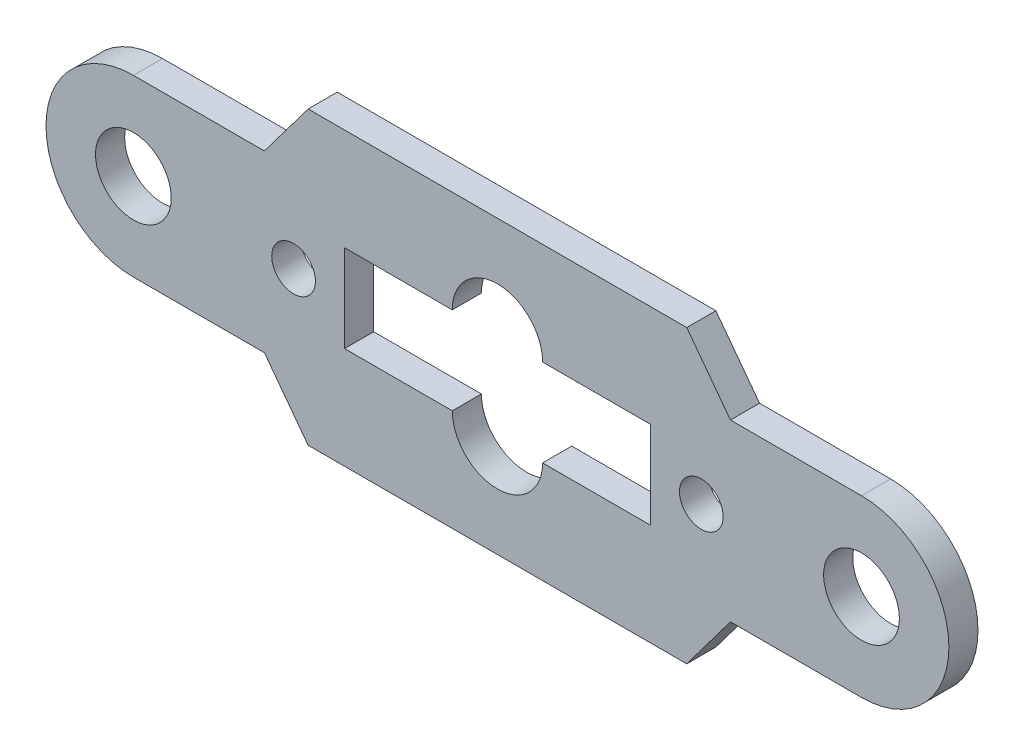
ISO-10303-21;
HEADER;
FILE_DESCRIPTION(('STEP AP214'),'2;1');
FILE_NAME('part.step','',(''),(''),'','','');
FILE_SCHEMA(('AUTOMOTIVE_DESIGN { 1 0 10303 214 1 1 1 1 }'));
ENDSEC;
DATA;
#1=APPLICATION_CONTEXT('core data for automotive mechanical design processes');
#2=APPLICATION_PROTOCOL_DEFINITION('international standard','automotive_design',2000,#1);
#3=PRODUCT_CONTEXT('',#1,'mechanical');
#4=PRODUCT('Part','Part','',(#3));
#5=PRODUCT_RELATED_PRODUCT_CATEGORY('part','',(#4));
#6=PRODUCT_DEFINITION_FORMATION('','',#4);
#7=PRODUCT_DEFINITION_CONTEXT('part definition',#1,'design');
#8=PRODUCT_DEFINITION('design','',#6,#7);
#9=PRODUCT_DEFINITION_SHAPE('','',#8);
#10=(LENGTH_UNIT() NAMED_UNIT(*) SI_UNIT(.MILLI.,.METRE.));
#11=(NAMED_UNIT(*) PLANE_ANGLE_UNIT() SI_UNIT($,.RADIAN.));
#12=(NAMED_UNIT(*) SI_UNIT($,.STERADIAN.) SOLID_ANGLE_UNIT());
#13=UNCERTAINTY_MEASURE_WITH_UNIT(LENGTH_MEASURE(1.E-05),#10,'distance_accuracy_value','');
#14=(GEOMETRIC_REPRESENTATION_CONTEXT(3) GLOBAL_UNCERTAINTY_ASSIGNED_CONTEXT((#13)) GLOBAL_UNIT_ASSIGNED_CONTEXT((#10,
#11,#12)) REPRESENTATION_CONTEXT('',''));
#15=CARTESIAN_POINT('',(0.,0.,0.));
#16=DIRECTION('',(0.,0.,1.));
#17=DIRECTION('',(1.,0.,0.));
#18=AXIS2_PLACEMENT_3D('',#15,#16,#17);
#19=CARTESIAN_POINT('',(12.5,0.,1.));
#20=DIRECTION('',(0.,0.,-1.));
#21=DIRECTION('',(-1.,0.,0.));
#22=AXIS2_PLACEMENT_3D('',#19,#20,#21);
#23=CYLINDRICAL_SURFACE('',#22,3.);
#24=CARTESIAN_POINT('',(12.5,0.,0.));
#25=DIRECTION('',(0.,0.,1.));
#26=DIRECTION('',(-1.,0.,0.));
#27=AXIS2_PLACEMENT_3D('',#24,#25,#26);
#28=CIRCLE('',#27,3.);
#29=CARTESIAN_POINT('',(12.5,-3.,0.));
#30=VERTEX_POINT('',#29);
#31=CARTESIAN_POINT('',(12.5,3.,0.));
#32=VERTEX_POINT('',#31);
#33=EDGE_CURVE('E344',#30,#32,#28,.T.);
#34=ORIENTED_EDGE('',*,*,#33,.T.);
#35=DIRECTION('',(0.,0.,-1.));
#36=VECTOR('',#35,1.);
#37=CARTESIAN_POINT('',(12.5,3.,1.));
#38=LINE('',#37,#36);
#39=CARTESIAN_POINT('',(12.5,3.,1.));
#40=VERTEX_POINT('',#39);
#41=EDGE_CURVE('E11',#40,#32,#38,.T.);
#42=ORIENTED_EDGE('',*,*,#41,.F.);
#43=CARTESIAN_POINT('',(12.5,0.,1.));
#44=DIRECTION('',(0.,0.,1.));
#45=DIRECTION('',(-1.,0.,0.));
#46=AXIS2_PLACEMENT_3D('',#43,#44,#45);
#47=CIRCLE('',#46,3.);
#48=CARTESIAN_POINT('',(12.5,-3.,1.));
#49=VERTEX_POINT('',#48);
#50=EDGE_CURVE('E77',#49,#40,#47,.T.);
#51=ORIENTED_EDGE('',*,*,#50,.F.);
#52=DIRECTION('',(0.,0.,-1.));
#53=VECTOR('',#52,1.);
#54=CARTESIAN_POINT('',(12.5,-3.,1.));
#55=LINE('',#54,#53);
#56=EDGE_CURVE('E313',#49,#30,#55,.T.);
#57=ORIENTED_EDGE('',*,*,#56,.T.);
#58=EDGE_LOOP('',(#34,#42,#51,#57));
#59=FACE_BOUND('',#58,.T.);
#60=ADVANCED_FACE('F32',(#59),#23,.T.);
#61=CARTESIAN_POINT('',(8.00000000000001,3.,1.));
#62=DIRECTION('',(0.,-1.,0.));
#63=DIRECTION('',(0.,0.,-1.));
#64=AXIS2_PLACEMENT_3D('',#61,#62,#63);
#65=PLANE('',#64);
#66=DIRECTION('',(-1.,0.,0.));
#67=VECTOR('',#66,1.);
#68=CARTESIAN_POINT('',(8.00000000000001,3.,0.));
#69=LINE('',#68,#67);
#70=CARTESIAN_POINT('',(8.00000000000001,3.,0.));
#71=VERTEX_POINT('',#70);
#72=EDGE_CURVE('E356',#32,#71,#69,.T.);
#73=ORIENTED_EDGE('',*,*,#72,.T.);
#74=DIRECTION('',(0.,0.,-1.));
#75=VECTOR('',#74,1.);
#76=CARTESIAN_POINT('',(8.00000000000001,3.,1.));
#77=LINE('',#76,#75);
#78=CARTESIAN_POINT('',(8.00000000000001,3.,1.));
#79=VERTEX_POINT('',#78);
#80=EDGE_CURVE('E39',#79,#71,#77,.T.);
#81=ORIENTED_EDGE('',*,*,#80,.F.);
#82=DIRECTION('',(-1.,0.,0.));
#83=VECTOR('',#82,1.);
#84=CARTESIAN_POINT('',(8.00000000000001,3.,1.));
#85=LINE('',#84,#83);
#86=EDGE_CURVE('E348',#40,#79,#85,.T.);
#87=ORIENTED_EDGE('',*,*,#86,.F.);
#88=ORIENTED_EDGE('',*,*,#41,.T.);
#89=EDGE_LOOP('',(#73,#81,#87,#88));
#90=FACE_BOUND('',#89,.T.);
#91=ADVANCED_FACE('F403',(#90),#65,.F.);
#92=CARTESIAN_POINT('',(6.5,5.,1.));
#93=DIRECTION('',(-0.799999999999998,-0.600000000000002,0.));
#94=DIRECTION('',(0.600000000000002,-0.799999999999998,0.));
#95=AXIS2_PLACEMENT_3D('',#92,#93,#94);
#96=PLANE('',#95);
#97=DIRECTION('',(-0.600000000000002,0.799999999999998,0.));
#98=VECTOR('',#97,1.);
#99=CARTESIAN_POINT('',(6.5,5.,0.));
#100=LINE('',#99,#98);
#101=CARTESIAN_POINT('',(6.5,5.,0.));
#102=VERTEX_POINT('',#101);
#103=EDGE_CURVE('E72',#71,#102,#100,.T.);
#104=ORIENTED_EDGE('',*,*,#103,.T.);
#105=DIRECTION('',(0.,0.,-1.));
#106=VECTOR('',#105,1.);
#107=CARTESIAN_POINT('',(6.5,5.,1.));
#108=LINE('',#107,#106);
#109=CARTESIAN_POINT('',(6.5,5.,1.));
#110=VERTEX_POINT('',#109);
#111=EDGE_CURVE('E354',#110,#102,#108,.T.);
#112=ORIENTED_EDGE('',*,*,#111,.F.);
#113=DIRECTION('',(-0.600000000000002,0.799999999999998,0.));
#114=VECTOR('',#113,1.);
#115=CARTESIAN_POINT('',(6.5,5.,1.));
#116=LINE('',#115,#114);
#117=EDGE_CURVE('E55',#79,#110,#116,.T.);
#118=ORIENTED_EDGE('',*,*,#117,.F.);
#119=ORIENTED_EDGE('',*,*,#80,.T.);
#120=EDGE_LOOP('',(#104,#112,#118,#119));
#121=FACE_BOUND('',#120,.T.);
#122=ADVANCED_FACE('F361',(#121),#96,.F.);
#123=CARTESIAN_POINT('',(0.,5.,1.));
#124=DIRECTION('',(0.,-1.,0.));
#125=DIRECTION('',(0.,0.,-1.));
#126=AXIS2_PLACEMENT_3D('',#123,#124,#125);
#127=PLANE('',#126);
#128=DIRECTION('',(-1.,0.,0.));
#129=VECTOR('',#128,1.);
#130=CARTESIAN_POINT('',(0.,5.,0.));
#131=LINE('',#130,#129);
#132=CARTESIAN_POINT('',(-6.5,5.,0.));
#133=VERTEX_POINT('',#132);
#134=EDGE_CURVE('E349',#102,#133,#131,.T.);
#135=ORIENTED_EDGE('',*,*,#134,.T.);
#136=DIRECTION('',(0.,0.,-1.));
#137=VECTOR('',#136,1.);
#138=CARTESIAN_POINT('',(-6.5,5.,1.));
#139=LINE('',#138,#137);
#140=CARTESIAN_POINT('',(-6.5,5.,1.));
#141=VERTEX_POINT('',#140);
#142=EDGE_CURVE('E266',#141,#133,#139,.T.);
#143=ORIENTED_EDGE('',*,*,#142,.F.);
#144=DIRECTION('',(-1.,0.,0.));
#145=VECTOR('',#144,1.);
#146=CARTESIAN_POINT('',(0.,5.,1.));
#147=LINE('',#146,#145);
#148=EDGE_CURVE('E352',#110,#141,#147,.T.);
#149=ORIENTED_EDGE('',*,*,#148,.F.);
#150=ORIENTED_EDGE('',*,*,#111,.T.);
#151=EDGE_LOOP('',(#135,#143,#149,#150));
#152=FACE_BOUND('',#151,.T.);
#153=ADVANCED_FACE('F370',(#152),#127,.F.);
#154=CARTESIAN_POINT('',(12.5,0.,1.));
#155=DIRECTION('',(0.,0.,-1.));
#156=DIRECTION('',(-1.,0.,0.));
#157=AXIS2_PLACEMENT_3D('',#154,#155,#156);
#158=PLANE('',#157);
#159=DIRECTION('',(1.,0.,0.));
#160=VECTOR('',#159,1.);
#161=CARTESIAN_POINT('',(-1.55,1.5,1.));
#162=LINE('',#161,#160);
#163=CARTESIAN_POINT('',(-5.25,1.5,1.));
#164=VERTEX_POINT('',#163);
#165=CARTESIAN_POINT('',(-1.55,1.5,1.));
#166=VERTEX_POINT('',#165);
#167=EDGE_CURVE('E237',#164,#166,#162,.T.);
#168=ORIENTED_EDGE('',*,*,#167,.T.);
#169=CARTESIAN_POINT('',(0.,1.5,1.));
#170=DIRECTION('',(0.,0.,1.));
#171=DIRECTION('',(1.,0.,0.));
#172=AXIS2_PLACEMENT_3D('',#169,#170,#171);
#173=CIRCLE('',#172,1.55);
#174=CARTESIAN_POINT('',(1.55,1.5,1.));
#175=VERTEX_POINT('',#174);
#176=EDGE_CURVE('E326',#175,#166,#173,.T.);
#177=ORIENTED_EDGE('',*,*,#176,.F.);
#178=DIRECTION('',(-1.,0.,0.));
#179=VECTOR('',#178,1.);
#180=CARTESIAN_POINT('',(1.55,1.5,1.));
#181=LINE('',#180,#179);
#182=CARTESIAN_POINT('',(5.25,1.5,1.));
#183=VERTEX_POINT('',#182);
#184=EDGE_CURVE('E333',#183,#175,#181,.T.);
#185=ORIENTED_EDGE('',*,*,#184,.F.);
#186=DIRECTION('',(0.,1.,0.));
#187=VECTOR('',#186,1.);
#188=CARTESIAN_POINT('',(5.25,0.,1.));
#189=LINE('',#188,#187);
#190=CARTESIAN_POINT('',(5.25,-1.5,1.));
#191=VERTEX_POINT('',#190);
#192=EDGE_CURVE('E320',#191,#183,#189,.T.);
#193=ORIENTED_EDGE('',*,*,#192,.F.);
#194=DIRECTION('',(-1.,0.,0.));
#195=VECTOR('',#194,1.);
#196=CARTESIAN_POINT('',(1.55,-1.5,1.));
#197=LINE('',#196,#195);
#198=CARTESIAN_POINT('',(1.55,-1.5,1.));
#199=VERTEX_POINT('',#198);
#200=EDGE_CURVE('E282',#191,#199,#197,.T.);
#201=ORIENTED_EDGE('',*,*,#200,.T.);
#202=CARTESIAN_POINT('',(0.,-1.5,1.));
#203=DIRECTION('',(0.,0.,-1.));
#204=DIRECTION('',(1.,0.,0.));
#205=AXIS2_PLACEMENT_3D('',#202,#203,#204);
#206=CIRCLE('',#205,1.55);
#207=CARTESIAN_POINT('',(-1.55,-1.5,1.));
#208=VERTEX_POINT('',#207);
#209=EDGE_CURVE('E283',#199,#208,#206,.T.);
#210=ORIENTED_EDGE('',*,*,#209,.T.);
#211=DIRECTION('',(1.,0.,0.));
#212=VECTOR('',#211,1.);
#213=CARTESIAN_POINT('',(-1.55,-1.5,1.));
#214=LINE('',#213,#212);
#215=CARTESIAN_POINT('',(-5.25,-1.5,1.));
#216=VERTEX_POINT('',#215);
#217=EDGE_CURVE('E195',#216,#208,#214,.T.);
#218=ORIENTED_EDGE('',*,*,#217,.F.);
#219=DIRECTION('',(0.,1.,0.));
#220=VECTOR('',#219,1.);
#221=CARTESIAN_POINT('',(-5.25,0.,1.));
#222=LINE('',#221,#220);
#223=EDGE_CURVE('E232',#216,#164,#222,.T.);
#224=ORIENTED_EDGE('',*,*,#223,.T.);
#225=EDGE_LOOP('',(#168,#177,#185,#193,#201,#210,#218,#224));
#226=FACE_BOUND('',#225,.T.);
#227=CARTESIAN_POINT('',(7.,0.,1.));
#228=DIRECTION('',(0.,0.,1.));
#229=DIRECTION('',(1.,0.,0.));
#230=AXIS2_PLACEMENT_3D('',#227,#228,#229);
#231=CIRCLE('',#230,0.750000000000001);
#232=CARTESIAN_POINT('',(7.75,0.,1.));
#233=VERTEX_POINT('',#232);
#234=EDGE_CURVE('E316',#233,#233,#231,.T.);
#235=ORIENTED_EDGE('',*,*,#234,.F.);
#236=EDGE_LOOP('',(#235));
#237=FACE_BOUND('',#236,.T.);
#238=CARTESIAN_POINT('',(12.5,0.,1.));
#239=DIRECTION('',(0.,0.,1.));
#240=DIRECTION('',(1.,0.,0.));
#241=AXIS2_PLACEMENT_3D('',#238,#239,#240);
#242=CIRCLE('',#241,1.3);
#243=CARTESIAN_POINT('',(13.8,0.,1.));
#244=VERTEX_POINT('',#243);
#245=EDGE_CURVE('E339',#244,#244,#242,.T.);
#246=ORIENTED_EDGE('',*,*,#245,.F.);
#247=EDGE_LOOP('',(#246));
#248=FACE_BOUND('',#247,.T.);
#249=ORIENTED_EDGE('',*,*,#148,.T.);
#250=DIRECTION('',(0.600000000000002,0.799999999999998,0.));
#251=VECTOR('',#250,1.);
#252=CARTESIAN_POINT('',(-6.5,5.,1.));
#253=LINE('',#252,#251);
#254=CARTESIAN_POINT('',(-8.00000000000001,3.,1.));
#255=VERTEX_POINT('',#254);
#256=EDGE_CURVE('E263',#255,#141,#253,.T.);
#257=ORIENTED_EDGE('',*,*,#256,.F.);
#258=DIRECTION('',(1.,0.,0.));
#259=VECTOR('',#258,1.);
#260=CARTESIAN_POINT('',(-8.00000000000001,3.,1.));
#261=LINE('',#260,#259);
#262=CARTESIAN_POINT('',(-12.5,3.,1.));
#263=VERTEX_POINT('',#262);
#264=EDGE_CURVE('E259',#263,#255,#261,.T.);
#265=ORIENTED_EDGE('',*,*,#264,.F.);
#266=CARTESIAN_POINT('',(-12.5,0.,1.));
#267=DIRECTION('',(0.,0.,-1.));
#268=DIRECTION('',(1.,0.,0.));
#269=AXIS2_PLACEMENT_3D('',#266,#267,#268);
#270=CIRCLE('',#269,3.);
#271=CARTESIAN_POINT('',(-12.5,-3.,1.));
#272=VERTEX_POINT('',#271);
#273=EDGE_CURVE('E256',#272,#263,#270,.T.);
#274=ORIENTED_EDGE('',*,*,#273,.F.);
#275=DIRECTION('',(1.,0.,0.));
#276=VECTOR('',#275,1.);
#277=CARTESIAN_POINT('',(-8.00000000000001,-3.,1.));
#278=LINE('',#277,#276);
#279=CARTESIAN_POINT('',(-8.00000000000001,-3.,1.));
#280=VERTEX_POINT('',#279);
#281=EDGE_CURVE('E209',#272,#280,#278,.T.);
#282=ORIENTED_EDGE('',*,*,#281,.T.);
#283=DIRECTION('',(0.600000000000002,-0.799999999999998,0.));
#284=VECTOR('',#283,1.);
#285=CARTESIAN_POINT('',(-6.5,-5.,1.));
#286=LINE('',#285,#284);
#287=CARTESIAN_POINT('',(-6.5,-5.,1.));
#288=VERTEX_POINT('',#287);
#289=EDGE_CURVE('E212',#280,#288,#286,.T.);
#290=ORIENTED_EDGE('',*,*,#289,.T.);
#291=DIRECTION('',(-1.,0.,0.));
#292=VECTOR('',#291,1.);
#293=CARTESIAN_POINT('',(0.,-5.,1.));
#294=LINE('',#293,#292);
#295=CARTESIAN_POINT('',(6.5,-5.,1.));
#296=VERTEX_POINT('',#295);
#297=EDGE_CURVE('E299',#296,#288,#294,.T.);
#298=ORIENTED_EDGE('',*,*,#297,.F.);
#299=DIRECTION('',(-0.600000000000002,-0.799999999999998,0.));
#300=VECTOR('',#299,1.);
#301=CARTESIAN_POINT('',(6.5,-5.,1.));
#302=LINE('',#301,#300);
#303=CARTESIAN_POINT('',(8.00000000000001,-3.,1.));
#304=VERTEX_POINT('',#303);
#305=EDGE_CURVE('E295',#304,#296,#302,.T.);
#306=ORIENTED_EDGE('',*,*,#305,.F.);
#307=DIRECTION('',(-1.,0.,0.));
#308=VECTOR('',#307,1.);
#309=CARTESIAN_POINT('',(8.00000000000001,-3.,1.));
#310=LINE('',#309,#308);
#311=EDGE_CURVE('E292',#49,#304,#310,.T.);
#312=ORIENTED_EDGE('',*,*,#311,.F.);
#313=ORIENTED_EDGE('',*,*,#50,.T.);
#314=ORIENTED_EDGE('',*,*,#86,.T.);
#315=ORIENTED_EDGE('',*,*,#117,.T.);
#316=EDGE_LOOP('',(#249,#257,#265,#274,#282,#290,#298,#306,#312,#313,#314,#315));
#317=FACE_BOUND('',#316,.T.);
#318=CARTESIAN_POINT('',(-7.,0.,1.));
#319=DIRECTION('',(0.,0.,-1.));
#320=DIRECTION('',(-1.,0.,0.));
#321=AXIS2_PLACEMENT_3D('',#318,#319,#320);
#322=CIRCLE('',#321,0.750000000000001);
#323=CARTESIAN_POINT('',(-7.75,0.,1.));
#324=VERTEX_POINT('',#323);
#325=EDGE_CURVE('E228',#324,#324,#322,.T.);
#326=ORIENTED_EDGE('',*,*,#325,.T.);
#327=EDGE_LOOP('',(#326));
#328=FACE_BOUND('',#327,.T.);
#329=CARTESIAN_POINT('',(-12.5,0.,1.));
#330=DIRECTION('',(0.,0.,-1.));
#331=DIRECTION('',(-1.,0.,0.));
#332=AXIS2_PLACEMENT_3D('',#329,#330,#331);
#333=CIRCLE('',#332,1.3);
#334=CARTESIAN_POINT('',(-13.8,0.,1.));
#335=VERTEX_POINT('',#334);
#336=EDGE_CURVE('E248',#335,#335,#333,.T.);
#337=ORIENTED_EDGE('',*,*,#336,.T.);
#338=EDGE_LOOP('',(#337));
#339=FACE_BOUND('',#338,.T.);
#340=ADVANCED_FACE('F375',(#226,#237,#248,#317,#328,#339),#158,.F.);
#341=CARTESIAN_POINT('',(12.5,0.,0.));
#342=DIRECTION('',(0.,0.,-1.));
#343=DIRECTION('',(-1.,0.,0.));
#344=AXIS2_PLACEMENT_3D('',#341,#342,#343);
#345=PLANE('',#344);
#346=CARTESIAN_POINT('',(0.,1.5,0.));
#347=DIRECTION('',(0.,0.,1.));
#348=DIRECTION('',(1.,0.,0.));
#349=AXIS2_PLACEMENT_3D('',#346,#347,#348);
#350=CIRCLE('',#349,1.55);
#351=CARTESIAN_POINT('',(1.55,1.5,0.));
#352=VERTEX_POINT('',#351);
#353=CARTESIAN_POINT('',(-1.55,1.5,0.));
#354=VERTEX_POINT('',#353);
#355=EDGE_CURVE('E328',#352,#354,#350,.T.);
#356=ORIENTED_EDGE('',*,*,#355,.T.);
#357=DIRECTION('',(1.,0.,0.));
#358=VECTOR('',#357,1.);
#359=CARTESIAN_POINT('',(-1.55,1.5,0.));
#360=LINE('',#359,#358);
#361=CARTESIAN_POINT('',(-5.25,1.5,0.));
#362=VERTEX_POINT('',#361);
#363=EDGE_CURVE('E236',#362,#354,#360,.T.);
#364=ORIENTED_EDGE('',*,*,#363,.F.);
#365=DIRECTION('',(0.,1.,0.));
#366=VECTOR('',#365,1.);
#367=CARTESIAN_POINT('',(-5.25,0.,0.));
#368=LINE('',#367,#366);
#369=CARTESIAN_POINT('',(-5.25,-1.5,0.));
#370=VERTEX_POINT('',#369);
#371=EDGE_CURVE('E204',#370,#362,#368,.T.);
#372=ORIENTED_EDGE('',*,*,#371,.F.);
#373=DIRECTION('',(1.,0.,0.));
#374=VECTOR('',#373,1.);
#375=CARTESIAN_POINT('',(-1.55,-1.5,0.));
#376=LINE('',#375,#374);
#377=CARTESIAN_POINT('',(-1.55,-1.5,0.));
#378=VERTEX_POINT('',#377);
#379=EDGE_CURVE('E193',#370,#378,#376,.T.);
#380=ORIENTED_EDGE('',*,*,#379,.T.);
#381=CARTESIAN_POINT('',(0.,-1.5,0.));
#382=DIRECTION('',(0.,0.,-1.));
#383=DIRECTION('',(1.,0.,0.));
#384=AXIS2_PLACEMENT_3D('',#381,#382,#383);
#385=CIRCLE('',#384,1.55);
#386=CARTESIAN_POINT('',(1.55,-1.5,0.));
#387=VERTEX_POINT('',#386);
#388=EDGE_CURVE('E176',#387,#378,#385,.T.);
#389=ORIENTED_EDGE('',*,*,#388,.F.);
#390=DIRECTION('',(-1.,0.,0.));
#391=VECTOR('',#390,1.);
#392=CARTESIAN_POINT('',(1.55,-1.5,0.));
#393=LINE('',#392,#391);
#394=CARTESIAN_POINT('',(5.25,-1.5,0.));
#395=VERTEX_POINT('',#394);
#396=EDGE_CURVE('E188',#395,#387,#393,.T.);
#397=ORIENTED_EDGE('',*,*,#396,.F.);
#398=DIRECTION('',(0.,1.,0.));
#399=VECTOR('',#398,1.);
#400=CARTESIAN_POINT('',(5.25,0.,0.));
#401=LINE('',#400,#399);
#402=CARTESIAN_POINT('',(5.25,1.5,0.));
#403=VERTEX_POINT('',#402);
#404=EDGE_CURVE('E323',#395,#403,#401,.T.);
#405=ORIENTED_EDGE('',*,*,#404,.T.);
#406=DIRECTION('',(-1.,0.,0.));
#407=VECTOR('',#406,1.);
#408=CARTESIAN_POINT('',(1.55,1.5,0.));
#409=LINE('',#408,#407);
#410=EDGE_CURVE('E46',#403,#352,#409,.T.);
#411=ORIENTED_EDGE('',*,*,#410,.T.);
#412=EDGE_LOOP('',(#356,#364,#372,#380,#389,#397,#405,#411));
#413=FACE_BOUND('',#412,.T.);
#414=CARTESIAN_POINT('',(7.,0.,0.));
#415=DIRECTION('',(0.,0.,1.));
#416=DIRECTION('',(1.,0.,0.));
#417=AXIS2_PLACEMENT_3D('',#414,#415,#416);
#418=CIRCLE('',#417,0.750000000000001);
#419=CARTESIAN_POINT('',(7.75,0.,0.));
#420=VERTEX_POINT('',#419);
#421=EDGE_CURVE('E317',#420,#420,#418,.T.);
#422=ORIENTED_EDGE('',*,*,#421,.T.);
#423=EDGE_LOOP('',(#422));
#424=FACE_BOUND('',#423,.T.);
#425=CARTESIAN_POINT('',(12.5,0.,0.));
#426=DIRECTION('',(0.,0.,1.));
#427=DIRECTION('',(1.,0.,0.));
#428=AXIS2_PLACEMENT_3D('',#425,#426,#427);
#429=CIRCLE('',#428,1.3);
#430=CARTESIAN_POINT('',(13.8,0.,0.));
#431=VERTEX_POINT('',#430);
#432=EDGE_CURVE('E341',#431,#431,#429,.T.);
#433=ORIENTED_EDGE('',*,*,#432,.T.);
#434=EDGE_LOOP('',(#433));
#435=FACE_BOUND('',#434,.T.);
#436=DIRECTION('',(0.600000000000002,0.799999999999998,0.));
#437=VECTOR('',#436,1.);
#438=CARTESIAN_POINT('',(-6.5,5.,0.));
#439=LINE('',#438,#437);
#440=CARTESIAN_POINT('',(-8.00000000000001,3.,0.));
#441=VERTEX_POINT('',#440);
#442=EDGE_CURVE('E260',#441,#133,#439,.T.);
#443=ORIENTED_EDGE('',*,*,#442,.T.);
#444=ORIENTED_EDGE('',*,*,#134,.F.);
#445=ORIENTED_EDGE('',*,*,#103,.F.);
#446=ORIENTED_EDGE('',*,*,#72,.F.);
#447=ORIENTED_EDGE('',*,*,#33,.F.);
#448=DIRECTION('',(-1.,0.,0.));
#449=VECTOR('',#448,1.);
#450=CARTESIAN_POINT('',(8.00000000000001,-3.,0.));
#451=LINE('',#450,#449);
#452=CARTESIAN_POINT('',(8.00000000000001,-3.,0.));
#453=VERTEX_POINT('',#452);
#454=EDGE_CURVE('E289',#30,#453,#451,.T.);
#455=ORIENTED_EDGE('',*,*,#454,.T.);
#456=DIRECTION('',(-0.600000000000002,-0.799999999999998,0.));
#457=VECTOR('',#456,1.);
#458=CARTESIAN_POINT('',(6.5,-5.,0.));
#459=LINE('',#458,#457);
#460=CARTESIAN_POINT('',(6.5,-5.,0.));
#461=VERTEX_POINT('',#460);
#462=EDGE_CURVE('E304',#453,#461,#459,.T.);
#463=ORIENTED_EDGE('',*,*,#462,.T.);
#464=DIRECTION('',(-1.,0.,0.));
#465=VECTOR('',#464,1.);
#466=CARTESIAN_POINT('',(0.,-5.,0.));
#467=LINE('',#466,#465);
#468=CARTESIAN_POINT('',(-6.5,-5.,0.));
#469=VERTEX_POINT('',#468);
#470=EDGE_CURVE('E296',#461,#469,#467,.T.);
#471=ORIENTED_EDGE('',*,*,#470,.T.);
#472=DIRECTION('',(0.600000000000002,-0.799999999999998,0.));
#473=VECTOR('',#472,1.);
#474=CARTESIAN_POINT('',(-6.5,-5.,0.));
#475=LINE('',#474,#473);
#476=CARTESIAN_POINT('',(-8.00000000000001,-3.,0.));
#477=VERTEX_POINT('',#476);
#478=EDGE_CURVE('E213',#477,#469,#475,.T.);
#479=ORIENTED_EDGE('',*,*,#478,.F.);
#480=DIRECTION('',(1.,0.,0.));
#481=VECTOR('',#480,1.);
#482=CARTESIAN_POINT('',(-8.00000000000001,-3.,0.));
#483=LINE('',#482,#481);
#484=CARTESIAN_POINT('',(-12.5,-3.,0.));
#485=VERTEX_POINT('',#484);
#486=EDGE_CURVE('E196',#485,#477,#483,.T.);
#487=ORIENTED_EDGE('',*,*,#486,.F.);
#488=CARTESIAN_POINT('',(-12.5,0.,0.));
#489=DIRECTION('',(0.,0.,-1.));
#490=DIRECTION('',(1.,0.,0.));
#491=AXIS2_PLACEMENT_3D('',#488,#489,#490);
#492=CIRCLE('',#491,3.);
#493=CARTESIAN_POINT('',(-12.5,3.,0.));
#494=VERTEX_POINT('',#493);
#495=EDGE_CURVE('E253',#485,#494,#492,.T.);
#496=ORIENTED_EDGE('',*,*,#495,.T.);
#497=DIRECTION('',(1.,0.,0.));
#498=VECTOR('',#497,1.);
#499=CARTESIAN_POINT('',(-8.00000000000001,3.,0.));
#500=LINE('',#499,#498);
#501=EDGE_CURVE('E269',#494,#441,#500,.T.);
#502=ORIENTED_EDGE('',*,*,#501,.T.);
#503=EDGE_LOOP('',(#443,#444,#445,#446,#447,#455,#463,#471,#479,#487,#496,#502));
#504=FACE_BOUND('',#503,.T.);
#505=CARTESIAN_POINT('',(-7.,0.,0.));
#506=DIRECTION('',(0.,0.,-1.));
#507=DIRECTION('',(-1.,0.,0.));
#508=AXIS2_PLACEMENT_3D('',#505,#506,#507);
#509=CIRCLE('',#508,0.750000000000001);
#510=CARTESIAN_POINT('',(-7.75,0.,0.));
#511=VERTEX_POINT('',#510);
#512=EDGE_CURVE('E229',#511,#511,#509,.T.);
#513=ORIENTED_EDGE('',*,*,#512,.F.);
#514=EDGE_LOOP('',(#513));
#515=FACE_BOUND('',#514,.T.);
#516=CARTESIAN_POINT('',(-12.5,0.,0.));
#517=DIRECTION('',(0.,0.,-1.));
#518=DIRECTION('',(-1.,0.,0.));
#519=AXIS2_PLACEMENT_3D('',#516,#517,#518);
#520=CIRCLE('',#519,1.3);
#521=CARTESIAN_POINT('',(-13.8,0.,0.));
#522=VERTEX_POINT('',#521);
#523=EDGE_CURVE('E250',#522,#522,#520,.T.);
#524=ORIENTED_EDGE('',*,*,#523,.F.);
#525=EDGE_LOOP('',(#524));
#526=FACE_BOUND('',#525,.T.);
#527=ADVANCED_FACE('F200',(#413,#424,#435,#504,#515,#526),#345,.T.);
#528=CARTESIAN_POINT('',(12.5,0.,0.));
#529=DIRECTION('',(0.,0.,1.));
#530=DIRECTION('',(1.,0.,0.));
#531=AXIS2_PLACEMENT_3D('',#528,#529,#530);
#532=CYLINDRICAL_SURFACE('',#531,1.3);
#533=ORIENTED_EDGE('',*,*,#245,.T.);
#534=EDGE_LOOP('',(#533));
#535=FACE_BOUND('',#534,.T.);
#536=ORIENTED_EDGE('',*,*,#432,.F.);
#537=EDGE_LOOP('',(#536));
#538=FACE_BOUND('',#537,.T.);
#539=ADVANCED_FACE('F415',(#535,#538),#532,.F.);
#540=CARTESIAN_POINT('',(0.,1.5,0.));
#541=DIRECTION('',(0.,0.,1.));
#542=DIRECTION('',(1.,0.,0.));
#543=AXIS2_PLACEMENT_3D('',#540,#541,#542);
#544=CYLINDRICAL_SURFACE('',#543,1.55);
#545=ORIENTED_EDGE('',*,*,#355,.F.);
#546=DIRECTION('',(0.,0.,1.));
#547=VECTOR('',#546,1.);
#548=CARTESIAN_POINT('',(1.55,1.5,0.));
#549=LINE('',#548,#547);
#550=EDGE_CURVE('E337',#352,#175,#549,.T.);
#551=ORIENTED_EDGE('',*,*,#550,.T.);
#552=ORIENTED_EDGE('',*,*,#176,.T.);
#553=DIRECTION('',(0.,0.,1.));
#554=VECTOR('',#553,1.);
#555=CARTESIAN_POINT('',(-1.55,1.5,0.));
#556=LINE('',#555,#554);
#557=EDGE_CURVE('E245',#354,#166,#556,.T.);
#558=ORIENTED_EDGE('',*,*,#557,.F.);
#559=EDGE_LOOP('',(#545,#551,#552,#558));
#560=FACE_BOUND('',#559,.T.);
#561=ADVANCED_FACE('F421',(#560),#544,.F.);
#562=CARTESIAN_POINT('',(1.55,1.5,0.));
#563=DIRECTION('',(0.,1.,0.));
#564=DIRECTION('',(-1.,0.,0.));
#565=AXIS2_PLACEMENT_3D('',#562,#563,#564);
#566=PLANE('',#565);
#567=ORIENTED_EDGE('',*,*,#184,.T.);
#568=ORIENTED_EDGE('',*,*,#550,.F.);
#569=ORIENTED_EDGE('',*,*,#410,.F.);
#570=DIRECTION('',(0.,0.,1.));
#571=VECTOR('',#570,1.);
#572=CARTESIAN_POINT('',(5.25,1.5,0.));
#573=LINE('',#572,#571);
#574=EDGE_CURVE('E330',#403,#183,#573,.T.);
#575=ORIENTED_EDGE('',*,*,#574,.T.);
#576=EDGE_LOOP('',(#567,#568,#569,#575));
#577=FACE_BOUND('',#576,.T.);
#578=ADVANCED_FACE('F427',(#577),#566,.F.);
#579=CARTESIAN_POINT('',(5.25,0.,0.));
#580=DIRECTION('',(1.,0.,0.));
#581=DIRECTION('',(0.,0.,-1.));
#582=AXIS2_PLACEMENT_3D('',#579,#580,#581);
#583=PLANE('',#582);
#584=ORIENTED_EDGE('',*,*,#192,.T.);
#585=ORIENTED_EDGE('',*,*,#574,.F.);
#586=ORIENTED_EDGE('',*,*,#404,.F.);
#587=DIRECTION('',(0.,0.,1.));
#588=VECTOR('',#587,1.);
#589=CARTESIAN_POINT('',(5.25,-1.5,0.));
#590=LINE('',#589,#588);
#591=EDGE_CURVE('E187',#395,#191,#590,.T.);
#592=ORIENTED_EDGE('',*,*,#591,.T.);
#593=EDGE_LOOP('',(#584,#585,#586,#592));
#594=FACE_BOUND('',#593,.T.);
#595=ADVANCED_FACE('F423',(#594),#583,.F.);
#596=CARTESIAN_POINT('',(7.,0.,0.));
#597=DIRECTION('',(0.,0.,1.));
#598=DIRECTION('',(1.,0.,0.));
#599=AXIS2_PLACEMENT_3D('',#596,#597,#598);
#600=CYLINDRICAL_SURFACE('',#599,0.750000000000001);
#601=ORIENTED_EDGE('',*,*,#234,.T.);
#602=EDGE_LOOP('',(#601));
#603=FACE_BOUND('',#602,.T.);
#604=ORIENTED_EDGE('',*,*,#421,.F.);
#605=EDGE_LOOP('',(#604));
#606=FACE_BOUND('',#605,.T.);
#607=ADVANCED_FACE('F426',(#603,#606),#600,.F.);
#608=CARTESIAN_POINT('',(8.00000000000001,-3.,1.));
#609=DIRECTION('',(0.,1.,0.));
#610=DIRECTION('',(0.,0.,-1.));
#611=AXIS2_PLACEMENT_3D('',#608,#609,#610);
#612=PLANE('',#611);
#613=ORIENTED_EDGE('',*,*,#454,.F.);
#614=ORIENTED_EDGE('',*,*,#56,.F.);
#615=ORIENTED_EDGE('',*,*,#311,.T.);
#616=DIRECTION('',(0.,0.,-1.));
#617=VECTOR('',#616,1.);
#618=CARTESIAN_POINT('',(8.00000000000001,-3.,1.));
#619=LINE('',#618,#617);
#620=EDGE_CURVE('E310',#304,#453,#619,.T.);
#621=ORIENTED_EDGE('',*,*,#620,.T.);
#622=EDGE_LOOP('',(#613,#614,#615,#621));
#623=FACE_BOUND('',#622,.T.);
#624=ADVANCED_FACE('F401',(#623),#612,.F.);
#625=CARTESIAN_POINT('',(6.5,-5.,1.));
#626=DIRECTION('',(-0.799999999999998,0.600000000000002,0.));
#627=DIRECTION('',(0.600000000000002,0.799999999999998,0.));
#628=AXIS2_PLACEMENT_3D('',#625,#626,#627);
#629=PLANE('',#628);
#630=ORIENTED_EDGE('',*,*,#462,.F.);
#631=ORIENTED_EDGE('',*,*,#620,.F.);
#632=ORIENTED_EDGE('',*,*,#305,.T.);
#633=DIRECTION('',(0.,0.,-1.));
#634=VECTOR('',#633,1.);
#635=CARTESIAN_POINT('',(6.5,-5.,1.));
#636=LINE('',#635,#634);
#637=EDGE_CURVE('E301',#296,#461,#636,.T.);
#638=ORIENTED_EDGE('',*,*,#637,.T.);
#639=EDGE_LOOP('',(#630,#631,#632,#638));
#640=FACE_BOUND('',#639,.T.);
#641=ADVANCED_FACE('F397',(#640),#629,.F.);
#642=CARTESIAN_POINT('',(0.,-5.,1.));
#643=DIRECTION('',(0.,1.,0.));
#644=DIRECTION('',(0.,0.,-1.));
#645=AXIS2_PLACEMENT_3D('',#642,#643,#644);
#646=PLANE('',#645);
#647=ORIENTED_EDGE('',*,*,#470,.F.);
#648=ORIENTED_EDGE('',*,*,#637,.F.);
#649=ORIENTED_EDGE('',*,*,#297,.T.);
#650=DIRECTION('',(0.,0.,-1.));
#651=VECTOR('',#650,1.);
#652=CARTESIAN_POINT('',(-6.5,-5.,1.));
#653=LINE('',#652,#651);
#654=EDGE_CURVE('E216',#288,#469,#653,.T.);
#655=ORIENTED_EDGE('',*,*,#654,.T.);
#656=EDGE_LOOP('',(#647,#648,#649,#655));
#657=FACE_BOUND('',#656,.T.);
#658=ADVANCED_FACE('F394',(#657),#646,.F.);
#659=CARTESIAN_POINT('',(0.,-1.5,0.));
#660=DIRECTION('',(0.,0.,1.));
#661=DIRECTION('',(1.,0.,0.));
#662=AXIS2_PLACEMENT_3D('',#659,#660,#661);
#663=CYLINDRICAL_SURFACE('',#662,1.55);
#664=ORIENTED_EDGE('',*,*,#388,.T.);
#665=DIRECTION('',(0.,0.,1.));
#666=VECTOR('',#665,1.);
#667=CARTESIAN_POINT('',(-1.55,-1.5,0.));
#668=LINE('',#667,#666);
#669=EDGE_CURVE('E180',#378,#208,#668,.T.);
#670=ORIENTED_EDGE('',*,*,#669,.T.);
#671=ORIENTED_EDGE('',*,*,#209,.F.);
#672=DIRECTION('',(0.,0.,1.));
#673=VECTOR('',#672,1.);
#674=CARTESIAN_POINT('',(1.55,-1.5,0.));
#675=LINE('',#674,#673);
#676=EDGE_CURVE('E182',#387,#199,#675,.T.);
#677=ORIENTED_EDGE('',*,*,#676,.F.);
#678=EDGE_LOOP('',(#664,#670,#671,#677));
#679=FACE_BOUND('',#678,.T.);
#680=ADVANCED_FACE('F178',(#679),#663,.F.);
#681=CARTESIAN_POINT('',(1.55,-1.5,0.));
#682=DIRECTION('',(0.,-1.,0.));
#683=DIRECTION('',(-1.,0.,0.));
#684=AXIS2_PLACEMENT_3D('',#681,#682,#683);
#685=PLANE('',#684);
#686=ORIENTED_EDGE('',*,*,#200,.F.);
#687=ORIENTED_EDGE('',*,*,#591,.F.);
#688=ORIENTED_EDGE('',*,*,#396,.T.);
#689=ORIENTED_EDGE('',*,*,#676,.T.);
#690=EDGE_LOOP('',(#686,#687,#688,#689));
#691=FACE_BOUND('',#690,.T.);
#692=ADVANCED_FACE('F443',(#691),#685,.F.);
#693=CARTESIAN_POINT('',(-12.5,0.,1.));
#694=DIRECTION('',(0.,0.,-1.));
#695=DIRECTION('',(1.,0.,0.));
#696=AXIS2_PLACEMENT_3D('',#693,#694,#695);
#697=CYLINDRICAL_SURFACE('',#696,3.);
#698=ORIENTED_EDGE('',*,*,#495,.F.);
#699=DIRECTION('',(0.,0.,-1.));
#700=VECTOR('',#699,1.);
#701=CARTESIAN_POINT('',(-12.5,-3.,1.));
#702=LINE('',#701,#700);
#703=EDGE_CURVE('E225',#272,#485,#702,.T.);
#704=ORIENTED_EDGE('',*,*,#703,.F.);
#705=ORIENTED_EDGE('',*,*,#273,.T.);
#706=DIRECTION('',(0.,0.,-1.));
#707=VECTOR('',#706,1.);
#708=CARTESIAN_POINT('',(-12.5,3.,1.));
#709=LINE('',#708,#707);
#710=EDGE_CURVE('E279',#263,#494,#709,.T.);
#711=ORIENTED_EDGE('',*,*,#710,.T.);
#712=EDGE_LOOP('',(#698,#704,#705,#711));
#713=FACE_BOUND('',#712,.T.);
#714=ADVANCED_FACE('F384',(#713),#697,.T.);
#715=CARTESIAN_POINT('',(-8.00000000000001,3.,1.));
#716=DIRECTION('',(0.,-1.,0.));
#717=DIRECTION('',(0.,0.,-1.));
#718=AXIS2_PLACEMENT_3D('',#715,#716,#717);
#719=PLANE('',#718);
#720=ORIENTED_EDGE('',*,*,#501,.F.);
#721=ORIENTED_EDGE('',*,*,#710,.F.);
#722=ORIENTED_EDGE('',*,*,#264,.T.);
#723=DIRECTION('',(0.,0.,-1.));
#724=VECTOR('',#723,1.);
#725=CARTESIAN_POINT('',(-8.00000000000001,3.,1.));
#726=LINE('',#725,#724);
#727=EDGE_CURVE('E276',#255,#441,#726,.T.);
#728=ORIENTED_EDGE('',*,*,#727,.T.);
#729=EDGE_LOOP('',(#720,#721,#722,#728));
#730=FACE_BOUND('',#729,.T.);
#731=ADVANCED_FACE('F381',(#730),#719,.F.);
#732=CARTESIAN_POINT('',(-6.5,5.,1.));
#733=DIRECTION('',(0.799999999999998,-0.600000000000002,0.));
#734=DIRECTION('',(-0.600000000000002,-0.799999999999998,0.));
#735=AXIS2_PLACEMENT_3D('',#732,#733,#734);
#736=PLANE('',#735);
#737=ORIENTED_EDGE('',*,*,#442,.F.);
#738=ORIENTED_EDGE('',*,*,#727,.F.);
#739=ORIENTED_EDGE('',*,*,#256,.T.);
#740=ORIENTED_EDGE('',*,*,#142,.T.);
#741=EDGE_LOOP('',(#737,#738,#739,#740));
#742=FACE_BOUND('',#741,.T.);
#743=ADVANCED_FACE('F373',(#742),#736,.F.);
#744=CARTESIAN_POINT('',(-12.5,0.,0.));
#745=DIRECTION('',(0.,0.,1.));
#746=DIRECTION('',(-1.,0.,0.));
#747=AXIS2_PLACEMENT_3D('',#744,#745,#746);
#748=CYLINDRICAL_SURFACE('',#747,1.3);
#749=ORIENTED_EDGE('',*,*,#336,.F.);
#750=EDGE_LOOP('',(#749));
#751=FACE_BOUND('',#750,.T.);
#752=ORIENTED_EDGE('',*,*,#523,.T.);
#753=EDGE_LOOP('',(#752));
#754=FACE_BOUND('',#753,.T.);
#755=ADVANCED_FACE('F455',(#751,#754),#748,.F.);
#756=CARTESIAN_POINT('',(-1.55,1.5,0.));
#757=DIRECTION('',(0.,1.,0.));
#758=DIRECTION('',(1.,0.,0.));
#759=AXIS2_PLACEMENT_3D('',#756,#757,#758);
#760=PLANE('',#759);
#761=ORIENTED_EDGE('',*,*,#167,.F.);
#762=DIRECTION('',(0.,0.,1.));
#763=VECTOR('',#762,1.);
#764=CARTESIAN_POINT('',(-5.25,1.5,0.));
#765=LINE('',#764,#763);
#766=EDGE_CURVE('E240',#362,#164,#765,.T.);
#767=ORIENTED_EDGE('',*,*,#766,.F.);
#768=ORIENTED_EDGE('',*,*,#363,.T.);
#769=ORIENTED_EDGE('',*,*,#557,.T.);
#770=EDGE_LOOP('',(#761,#767,#768,#769));
#771=FACE_BOUND('',#770,.T.);
#772=ADVANCED_FACE('F458',(#771),#760,.F.);
#773=CARTESIAN_POINT('',(-5.25,0.,0.));
#774=DIRECTION('',(-1.,0.,0.));
#775=DIRECTION('',(0.,0.,-1.));
#776=AXIS2_PLACEMENT_3D('',#773,#774,#775);
#777=PLANE('',#776);
#778=ORIENTED_EDGE('',*,*,#223,.F.);
#779=DIRECTION('',(0.,0.,1.));
#780=VECTOR('',#779,1.);
#781=CARTESIAN_POINT('',(-5.25,-1.5,0.));
#782=LINE('',#781,#780);
#783=EDGE_CURVE('E197',#370,#216,#782,.T.);
#784=ORIENTED_EDGE('',*,*,#783,.F.);
#785=ORIENTED_EDGE('',*,*,#371,.T.);
#786=ORIENTED_EDGE('',*,*,#766,.T.);
#787=EDGE_LOOP('',(#778,#784,#785,#786));
#788=FACE_BOUND('',#787,.T.);
#789=ADVANCED_FACE('F460',(#788),#777,.F.);
#790=CARTESIAN_POINT('',(-7.,0.,0.));
#791=DIRECTION('',(0.,0.,1.));
#792=DIRECTION('',(-1.,0.,0.));
#793=AXIS2_PLACEMENT_3D('',#790,#791,#792);
#794=CYLINDRICAL_SURFACE('',#793,0.750000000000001);
#795=ORIENTED_EDGE('',*,*,#325,.F.);
#796=EDGE_LOOP('',(#795));
#797=FACE_BOUND('',#796,.T.);
#798=ORIENTED_EDGE('',*,*,#512,.T.);
#799=EDGE_LOOP('',(#798));
#800=FACE_BOUND('',#799,.T.);
#801=ADVANCED_FACE('F463',(#797,#800),#794,.F.);
#802=CARTESIAN_POINT('',(-8.00000000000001,-3.,1.));
#803=DIRECTION('',(0.,1.,0.));
#804=DIRECTION('',(0.,0.,-1.));
#805=AXIS2_PLACEMENT_3D('',#802,#803,#804);
#806=PLANE('',#805);
#807=ORIENTED_EDGE('',*,*,#486,.T.);
#808=DIRECTION('',(0.,0.,-1.));
#809=VECTOR('',#808,1.);
#810=CARTESIAN_POINT('',(-8.00000000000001,-3.,1.));
#811=LINE('',#810,#809);
#812=EDGE_CURVE('E223',#280,#477,#811,.T.);
#813=ORIENTED_EDGE('',*,*,#812,.F.);
#814=ORIENTED_EDGE('',*,*,#281,.F.);
#815=ORIENTED_EDGE('',*,*,#703,.T.);
#816=EDGE_LOOP('',(#807,#813,#814,#815));
#817=FACE_BOUND('',#816,.T.);
#818=ADVANCED_FACE('F386',(#817),#806,.F.);
#819=CARTESIAN_POINT('',(-6.5,-5.,1.));
#820=DIRECTION('',(0.799999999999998,0.600000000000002,0.));
#821=DIRECTION('',(-0.600000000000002,0.799999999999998,0.));
#822=AXIS2_PLACEMENT_3D('',#819,#820,#821);
#823=PLANE('',#822);
#824=ORIENTED_EDGE('',*,*,#478,.T.);
#825=ORIENTED_EDGE('',*,*,#654,.F.);
#826=ORIENTED_EDGE('',*,*,#289,.F.);
#827=ORIENTED_EDGE('',*,*,#812,.T.);
#828=EDGE_LOOP('',(#824,#825,#826,#827));
#829=FACE_BOUND('',#828,.T.);
#830=ADVANCED_FACE('F392',(#829),#823,.F.);
#831=CARTESIAN_POINT('',(-1.55,-1.5,0.));
#832=DIRECTION('',(0.,-1.,0.));
#833=DIRECTION('',(1.,0.,0.));
#834=AXIS2_PLACEMENT_3D('',#831,#832,#833);
#835=PLANE('',#834);
#836=ORIENTED_EDGE('',*,*,#217,.T.);
#837=ORIENTED_EDGE('',*,*,#669,.F.);
#838=ORIENTED_EDGE('',*,*,#379,.F.);
#839=ORIENTED_EDGE('',*,*,#783,.T.);
#840=EDGE_LOOP('',(#836,#837,#838,#839));
#841=FACE_BOUND('',#840,.T.);
#842=ADVANCED_FACE('F192',(#841),#835,.F.);
#843=CLOSED_SHELL('',(#60,#91,#122,#153,#340,#527,#539,#561,#578,#595,#607,#624,#641,#658,#680,
#692,#714,#731,#743,#755,#772,#789,#801,#818,#830,#842));
#844=MANIFOLD_SOLID_BREP('B2',#843);
#845=ADVANCED_BREP_SHAPE_REPRESENTATION('',(#18,#844),#14);
#846=SHAPE_DEFINITION_REPRESENTATION(#9,#845);
ENDSEC;
END-ISO-10303-21;
